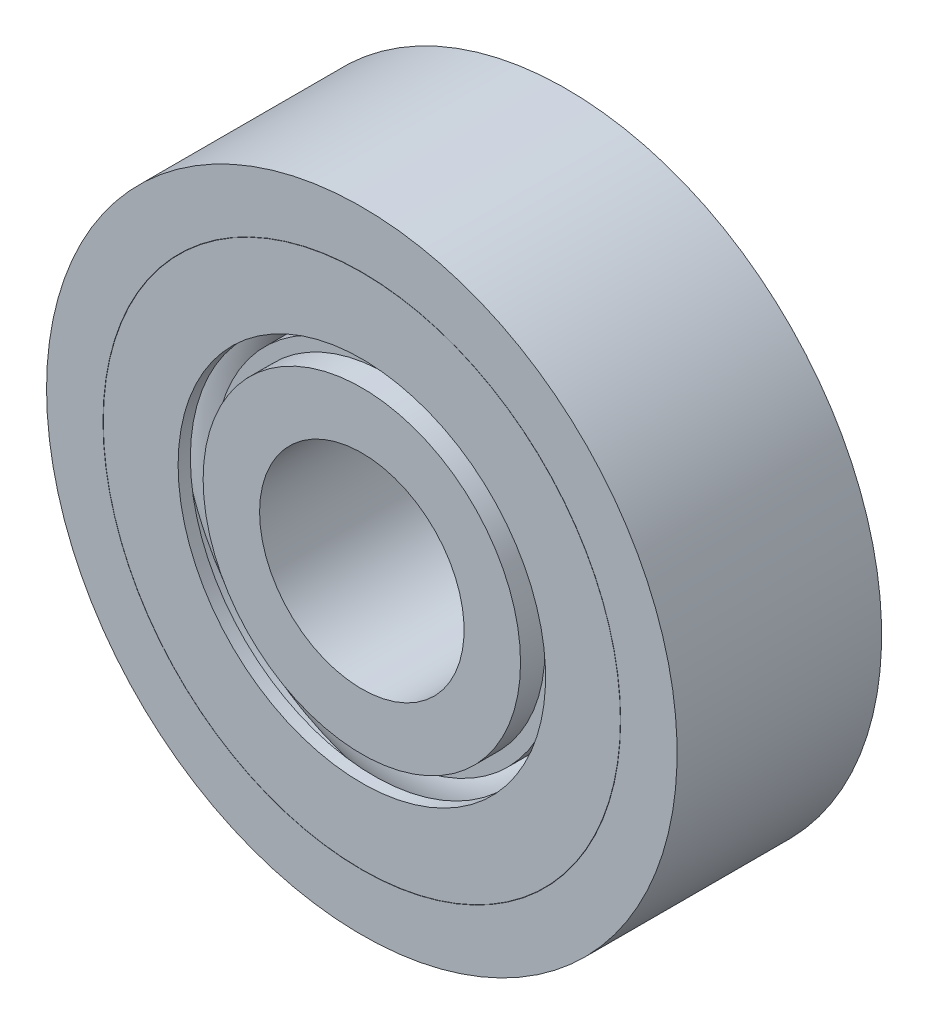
ISO-10303-21;
HEADER;
FILE_DESCRIPTION(('STEP AP214'),'2;1');
FILE_NAME('part.step','',(''),(''),'','','');
FILE_SCHEMA(('AUTOMOTIVE_DESIGN { 1 0 10303 214 1 1 1 1 }'));
ENDSEC;
DATA;
#1=APPLICATION_CONTEXT('core data for automotive mechanical design processes');
#2=APPLICATION_PROTOCOL_DEFINITION('international standard','automotive_design',2000,#1);
#3=PRODUCT_CONTEXT('',#1,'mechanical');
#4=PRODUCT('Part','Part','',(#3));
#5=PRODUCT_RELATED_PRODUCT_CATEGORY('part','',(#4));
#6=PRODUCT_DEFINITION_FORMATION('','',#4);
#7=PRODUCT_DEFINITION_CONTEXT('part definition',#1,'design');
#8=PRODUCT_DEFINITION('design','',#6,#7);
#9=PRODUCT_DEFINITION_SHAPE('','',#8);
#10=(LENGTH_UNIT() NAMED_UNIT(*) SI_UNIT(.MILLI.,.METRE.));
#11=(NAMED_UNIT(*) PLANE_ANGLE_UNIT() SI_UNIT($,.RADIAN.));
#12=(NAMED_UNIT(*) SI_UNIT($,.STERADIAN.) SOLID_ANGLE_UNIT());
#13=UNCERTAINTY_MEASURE_WITH_UNIT(LENGTH_MEASURE(1.E-05),#10,'distance_accuracy_value','');
#14=(GEOMETRIC_REPRESENTATION_CONTEXT(3) GLOBAL_UNCERTAINTY_ASSIGNED_CONTEXT((#13)) GLOBAL_UNIT_ASSIGNED_CONTEXT((#10,
#11,#12)) REPRESENTATION_CONTEXT('',''));
#15=CARTESIAN_POINT('',(0.,0.,0.));
#16=DIRECTION('',(0.,0.,1.));
#17=DIRECTION('',(1.,0.,0.));
#18=AXIS2_PLACEMENT_3D('',#15,#16,#17);
#19=CARTESIAN_POINT('',(0.,0.,6.60000000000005));
#20=DIRECTION('',(0.,0.,-1.));
#21=DIRECTION('',(-1.,0.,0.));
#22=AXIS2_PLACEMENT_3D('',#19,#20,#21);
#23=CYLINDRICAL_SURFACE('',#22,6.);
#24=CARTESIAN_POINT('',(0.,0.,6.00000000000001));
#25=DIRECTION('',(0.,0.,-1.));
#26=DIRECTION('',(-1.,0.,0.));
#27=AXIS2_PLACEMENT_3D('',#24,#25,#26);
#28=CIRCLE('',#27,6.);
#29=CARTESIAN_POINT('',(-6.,0.,6.00000000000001));
#30=VERTEX_POINT('',#29);
#31=EDGE_CURVE('P0_E18',#30,#30,#28,.F.);
#32=ORIENTED_EDGE('',*,*,#31,.T.);
#33=EDGE_LOOP('',(#32));
#34=FACE_BOUND('',#33,.T.);
#35=CARTESIAN_POINT('',(0.,0.,-6.00000000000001));
#36=DIRECTION('',(0.,0.,-1.));
#37=DIRECTION('',(-1.,0.,0.));
#38=AXIS2_PLACEMENT_3D('',#35,#36,#37);
#39=CIRCLE('',#38,6.);
#40=CARTESIAN_POINT('',(-6.,0.,-6.00000000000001));
#41=VERTEX_POINT('',#40);
#42=EDGE_CURVE('P0_E68',#41,#41,#39,.F.);
#43=ORIENTED_EDGE('',*,*,#42,.F.);
#44=EDGE_LOOP('',(#43));
#45=FACE_BOUND('',#44,.T.);
#46=ADVANCED_FACE('P0_F15',(#34,#45),#23,.F.);
#47=CARTESIAN_POINT('',(0.,0.,6.00000000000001));
#48=DIRECTION('',(0.,0.,-1.));
#49=DIRECTION('',(-1.,0.,0.));
#50=AXIS2_PLACEMENT_3D('',#47,#48,#49);
#51=PLANE('',#50);
#52=CARTESIAN_POINT('',(0.,0.,6.00000000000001));
#53=DIRECTION('',(0.,0.,-1.));
#54=DIRECTION('',(-1.,0.,0.));
#55=AXIS2_PLACEMENT_3D('',#52,#53,#54);
#56=CIRCLE('',#55,9.3125);
#57=CARTESIAN_POINT('',(-9.3125,0.,6.00000000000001));
#58=VERTEX_POINT('',#57);
#59=EDGE_CURVE('P0_E66',#58,#58,#56,.T.);
#60=ORIENTED_EDGE('',*,*,#59,.F.);
#61=EDGE_LOOP('',(#60));
#62=FACE_BOUND('',#61,.T.);
#63=ORIENTED_EDGE('',*,*,#31,.F.);
#64=EDGE_LOOP('',(#63));
#65=FACE_BOUND('',#64,.T.);
#66=ADVANCED_FACE('P0_F77',(#62,#65),#51,.F.);
#67=CARTESIAN_POINT('',(0.,0.,-6.00000000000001));
#68=DIRECTION('',(0.,0.,-1.));
#69=DIRECTION('',(-1.,0.,0.));
#70=AXIS2_PLACEMENT_3D('',#67,#68,#69);
#71=PLANE('',#70);
#72=CARTESIAN_POINT('',(0.,0.,-6.00000000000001));
#73=DIRECTION('',(0.,0.,-1.));
#74=DIRECTION('',(-1.,0.,0.));
#75=AXIS2_PLACEMENT_3D('',#72,#73,#74);
#76=CIRCLE('',#75,9.3125);
#77=CARTESIAN_POINT('',(-9.3125,0.,-6.00000000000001));
#78=VERTEX_POINT('',#77);
#79=EDGE_CURVE('P0_E63',#78,#78,#76,.F.);
#80=ORIENTED_EDGE('',*,*,#79,.F.);
#81=EDGE_LOOP('',(#80));
#82=FACE_BOUND('',#81,.T.);
#83=ORIENTED_EDGE('',*,*,#42,.T.);
#84=EDGE_LOOP('',(#83));
#85=FACE_BOUND('',#84,.T.);
#86=ADVANCED_FACE('P0_F79',(#82,#85),#71,.T.);
#87=CARTESIAN_POINT('',(0.,0.,6.60000000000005));
#88=DIRECTION('',(0.,0.,-1.));
#89=DIRECTION('',(-1.,0.,0.));
#90=AXIS2_PLACEMENT_3D('',#87,#88,#89);
#91=CYLINDRICAL_SURFACE('',#90,9.3125);
#92=ORIENTED_EDGE('',*,*,#59,.T.);
#93=EDGE_LOOP('',(#92));
#94=FACE_BOUND('',#93,.T.);
#95=CARTESIAN_POINT('',(0.,0.,4.56250000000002));
#96=DIRECTION('',(0.,0.,-1.));
#97=DIRECTION('',(-1.,0.,0.));
#98=AXIS2_PLACEMENT_3D('',#95,#96,#97);
#99=CIRCLE('',#98,9.3125);
#100=CARTESIAN_POINT('',(-9.3125,0.,4.56250000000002));
#101=VERTEX_POINT('',#100);
#102=EDGE_CURVE('P0_E60',#101,#101,#99,.F.);
#103=ORIENTED_EDGE('',*,*,#102,.T.);
#104=EDGE_LOOP('',(#103));
#105=FACE_BOUND('',#104,.T.);
#106=ADVANCED_FACE('P0_F86',(#94,#105),#91,.T.);
#107=CARTESIAN_POINT('',(0.,0.,6.60000000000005));
#108=DIRECTION('',(0.,0.,-1.));
#109=DIRECTION('',(-1.,0.,0.));
#110=AXIS2_PLACEMENT_3D('',#107,#108,#109);
#111=CYLINDRICAL_SURFACE('',#110,9.3125);
#112=ORIENTED_EDGE('',*,*,#79,.T.);
#113=EDGE_LOOP('',(#112));
#114=FACE_BOUND('',#113,.T.);
#115=CARTESIAN_POINT('',(0.,0.,-4.56250000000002));
#116=DIRECTION('',(0.,0.,-1.));
#117=DIRECTION('',(-1.,0.,0.));
#118=AXIS2_PLACEMENT_3D('',#115,#116,#117);
#119=CIRCLE('',#118,9.3125);
#120=CARTESIAN_POINT('',(-9.3125,0.,-4.56250000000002));
#121=VERTEX_POINT('',#120);
#122=EDGE_CURVE('P0_E57',#121,#121,#119,.F.);
#123=ORIENTED_EDGE('',*,*,#122,.F.);
#124=EDGE_LOOP('',(#123));
#125=FACE_BOUND('',#124,.T.);
#126=ADVANCED_FACE('P0_F173',(#114,#125),#111,.T.);
#127=CARTESIAN_POINT('',(0.,0.,4.56250000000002));
#128=DIRECTION('',(0.,0.,-1.));
#129=DIRECTION('',(-1.,0.,0.));
#130=AXIS2_PLACEMENT_3D('',#127,#128,#129);
#131=PLANE('',#130);
#132=CARTESIAN_POINT('',(0.,0.,4.56250000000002));
#133=DIRECTION('',(0.,0.,-1.));
#134=DIRECTION('',(-1.,0.,0.));
#135=AXIS2_PLACEMENT_3D('',#132,#133,#134);
#136=CIRCLE('',#135,10.075);
#137=CARTESIAN_POINT('',(-10.075,0.,4.56250000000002));
#138=VERTEX_POINT('',#137);
#139=EDGE_CURVE('P0_E54',#138,#138,#136,.T.);
#140=ORIENTED_EDGE('',*,*,#139,.F.);
#141=EDGE_LOOP('',(#140));
#142=FACE_BOUND('',#141,.T.);
#143=ORIENTED_EDGE('',*,*,#102,.F.);
#144=EDGE_LOOP('',(#143));
#145=FACE_BOUND('',#144,.T.);
#146=ADVANCED_FACE('P0_F167',(#142,#145),#131,.F.);
#147=CARTESIAN_POINT('',(0.,0.,-4.56250000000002));
#148=DIRECTION('',(0.,0.,-1.));
#149=DIRECTION('',(-1.,0.,0.));
#150=AXIS2_PLACEMENT_3D('',#147,#148,#149);
#151=PLANE('',#150);
#152=CARTESIAN_POINT('',(0.,0.,-4.56250000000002));
#153=DIRECTION('',(0.,0.,-1.));
#154=DIRECTION('',(-1.,0.,0.));
#155=AXIS2_PLACEMENT_3D('',#152,#153,#154);
#156=CIRCLE('',#155,10.075);
#157=CARTESIAN_POINT('',(-10.075,0.,-4.56250000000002));
#158=VERTEX_POINT('',#157);
#159=EDGE_CURVE('P0_E51',#158,#158,#156,.F.);
#160=ORIENTED_EDGE('',*,*,#159,.F.);
#161=EDGE_LOOP('',(#160));
#162=FACE_BOUND('',#161,.T.);
#163=ORIENTED_EDGE('',*,*,#122,.T.);
#164=EDGE_LOOP('',(#163));
#165=FACE_BOUND('',#164,.T.);
#166=ADVANCED_FACE('P0_F159',(#162,#165),#151,.T.);
#167=CARTESIAN_POINT('',(0.,0.,6.60000000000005));
#168=DIRECTION('',(0.,0.,-1.));
#169=DIRECTION('',(-1.,0.,0.));
#170=AXIS2_PLACEMENT_3D('',#167,#168,#169);
#171=CYLINDRICAL_SURFACE('',#170,10.075);
#172=ORIENTED_EDGE('',*,*,#139,.T.);
#173=EDGE_LOOP('',(#172));
#174=FACE_BOUND('',#173,.T.);
#175=CARTESIAN_POINT('',(0.,0.,2.2577865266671));
#176=DIRECTION('',(0.,0.,-1.));
#177=DIRECTION('',(0.,-1.,0.));
#178=AXIS2_PLACEMENT_3D('',#175,#176,#177);
#179=CIRCLE('',#178,10.0749999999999);
#180=CARTESIAN_POINT('',(0.,-10.0749999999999,2.2577865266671));
#181=VERTEX_POINT('',#180);
#182=EDGE_CURVE('P0_E30',#181,#181,#179,.T.);
#183=ORIENTED_EDGE('',*,*,#182,.F.);
#184=EDGE_LOOP('',(#183));
#185=FACE_BOUND('',#184,.T.);
#186=ADVANCED_FACE('P0_F156',(#174,#185),#171,.T.);
#187=CARTESIAN_POINT('',(0.,0.,6.60000000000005));
#188=DIRECTION('',(0.,0.,-1.));
#189=DIRECTION('',(-1.,0.,0.));
#190=AXIS2_PLACEMENT_3D('',#187,#188,#189);
#191=CYLINDRICAL_SURFACE('',#190,10.075);
#192=CARTESIAN_POINT('',(0.,0.,-2.25778652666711));
#193=DIRECTION('',(0.,0.,-1.));
#194=DIRECTION('',(0.,-1.,0.));
#195=AXIS2_PLACEMENT_3D('',#192,#193,#194);
#196=CIRCLE('',#195,10.0749999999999);
#197=CARTESIAN_POINT('',(0.,-10.0749999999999,-2.25778652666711));
#198=VERTEX_POINT('',#197);
#199=EDGE_CURVE('P0_E146',#198,#198,#196,.F.);
#200=ORIENTED_EDGE('',*,*,#199,.F.);
#201=EDGE_LOOP('',(#200));
#202=FACE_BOUND('',#201,.T.);
#203=ORIENTED_EDGE('',*,*,#159,.T.);
#204=EDGE_LOOP('',(#203));
#205=FACE_BOUND('',#204,.T.);
#206=ADVANCED_FACE('P0_F158',(#202,#205),#191,.T.);
#207=CARTESIAN_POINT('',(0.,0.,0.));
#208=DIRECTION('',(0.,0.,-1.));
#209=DIRECTION('',(0.,-1.,0.));
#210=AXIS2_PLACEMENT_3D('',#207,#208,#209);
#211=TOROIDAL_SURFACE('',#210,12.25,3.135);
#212=ORIENTED_EDGE('',*,*,#182,.T.);
#213=EDGE_LOOP('',(#212));
#214=FACE_BOUND('',#213,.T.);
#215=CARTESIAN_POINT('',(0.,0.,2.25778652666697));
#216=DIRECTION('',(0.,0.,-1.));
#217=DIRECTION('',(-1.,0.,0.));
#218=AXIS2_PLACEMENT_3D('',#215,#216,#217);
#219=CIRCLE('',#218,14.425);
#220=CARTESIAN_POINT('',(-14.425,0.,2.25778652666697));
#221=VERTEX_POINT('',#220);
#222=EDGE_CURVE('P0_E144',#221,#221,#219,.F.);
#223=ORIENTED_EDGE('',*,*,#222,.T.);
#224=EDGE_LOOP('',(#223));
#225=FACE_BOUND('',#224,.T.);
#226=ADVANCED_FACE('P0_F137',(#214,#225),#211,.T.);
#227=CARTESIAN_POINT('',(0.,0.,0.));
#228=DIRECTION('',(0.,0.,-1.));
#229=DIRECTION('',(0.,-1.,0.));
#230=AXIS2_PLACEMENT_3D('',#227,#228,#229);
#231=TOROIDAL_SURFACE('',#230,12.25,3.135);
#232=CARTESIAN_POINT('',(0.,0.,-2.25778652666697));
#233=DIRECTION('',(0.,0.,-1.));
#234=DIRECTION('',(-1.,0.,0.));
#235=AXIS2_PLACEMENT_3D('',#232,#233,#234);
#236=CIRCLE('',#235,14.425);
#237=CARTESIAN_POINT('',(-14.425,0.,-2.25778652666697));
#238=VERTEX_POINT('',#237);
#239=EDGE_CURVE('P0_E50',#238,#238,#236,.T.);
#240=ORIENTED_EDGE('',*,*,#239,.T.);
#241=EDGE_LOOP('',(#240));
#242=FACE_BOUND('',#241,.T.);
#243=ORIENTED_EDGE('',*,*,#199,.T.);
#244=EDGE_LOOP('',(#243));
#245=FACE_BOUND('',#244,.T.);
#246=ADVANCED_FACE('P0_F132',(#242,#245),#231,.T.);
#247=CARTESIAN_POINT('',(0.,0.,6.60000000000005));
#248=DIRECTION('',(0.,0.,-1.));
#249=DIRECTION('',(-1.,0.,0.));
#250=AXIS2_PLACEMENT_3D('',#247,#248,#249);
#251=CYLINDRICAL_SURFACE('',#250,14.425);
#252=ORIENTED_EDGE('',*,*,#222,.F.);
#253=EDGE_LOOP('',(#252));
#254=FACE_BOUND('',#253,.T.);
#255=CARTESIAN_POINT('',(0.,0.,4.56250000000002));
#256=DIRECTION('',(0.,0.,-1.));
#257=DIRECTION('',(-1.,0.,0.));
#258=AXIS2_PLACEMENT_3D('',#255,#256,#257);
#259=CIRCLE('',#258,14.425);
#260=CARTESIAN_POINT('',(-14.425,0.,4.56250000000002));
#261=VERTEX_POINT('',#260);
#262=EDGE_CURVE('P0_E47',#261,#261,#259,.F.);
#263=ORIENTED_EDGE('',*,*,#262,.T.);
#264=EDGE_LOOP('',(#263));
#265=FACE_BOUND('',#264,.T.);
#266=ADVANCED_FACE('P0_F128',(#254,#265),#251,.F.);
#267=CARTESIAN_POINT('',(0.,0.,6.60000000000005));
#268=DIRECTION('',(0.,0.,-1.));
#269=DIRECTION('',(-1.,0.,0.));
#270=AXIS2_PLACEMENT_3D('',#267,#268,#269);
#271=CYLINDRICAL_SURFACE('',#270,14.425);
#272=ORIENTED_EDGE('',*,*,#239,.F.);
#273=EDGE_LOOP('',(#272));
#274=FACE_BOUND('',#273,.T.);
#275=CARTESIAN_POINT('',(0.,0.,-4.56250000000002));
#276=DIRECTION('',(0.,0.,-1.));
#277=DIRECTION('',(-1.,0.,0.));
#278=AXIS2_PLACEMENT_3D('',#275,#276,#277);
#279=CIRCLE('',#278,14.425);
#280=CARTESIAN_POINT('',(-14.425,0.,-4.56250000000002));
#281=VERTEX_POINT('',#280);
#282=EDGE_CURVE('P0_E44',#281,#281,#279,.F.);
#283=ORIENTED_EDGE('',*,*,#282,.F.);
#284=EDGE_LOOP('',(#283));
#285=FACE_BOUND('',#284,.T.);
#286=ADVANCED_FACE('P0_F124',(#274,#285),#271,.F.);
#287=CARTESIAN_POINT('',(0.,0.,4.56250000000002));
#288=DIRECTION('',(0.,0.,-1.));
#289=DIRECTION('',(-1.,0.,0.));
#290=AXIS2_PLACEMENT_3D('',#287,#288,#289);
#291=PLANE('',#290);
#292=CARTESIAN_POINT('',(0.,0.,4.56250000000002));
#293=DIRECTION('',(0.,0.,-1.));
#294=DIRECTION('',(-1.,0.,0.));
#295=AXIS2_PLACEMENT_3D('',#292,#293,#294);
#296=CIRCLE('',#295,15.1875);
#297=CARTESIAN_POINT('',(-15.1875,0.,4.56250000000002));
#298=VERTEX_POINT('',#297);
#299=EDGE_CURVE('P0_E41',#298,#298,#296,.F.);
#300=ORIENTED_EDGE('',*,*,#299,.T.);
#301=EDGE_LOOP('',(#300));
#302=FACE_BOUND('',#301,.T.);
#303=ORIENTED_EDGE('',*,*,#262,.F.);
#304=EDGE_LOOP('',(#303));
#305=FACE_BOUND('',#304,.T.);
#306=ADVANCED_FACE('P0_F120',(#302,#305),#291,.F.);
#307=CARTESIAN_POINT('',(0.,0.,-4.56250000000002));
#308=DIRECTION('',(0.,0.,-1.));
#309=DIRECTION('',(-1.,0.,0.));
#310=AXIS2_PLACEMENT_3D('',#307,#308,#309);
#311=PLANE('',#310);
#312=CARTESIAN_POINT('',(0.,0.,-4.56250000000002));
#313=DIRECTION('',(0.,0.,-1.));
#314=DIRECTION('',(-1.,0.,0.));
#315=AXIS2_PLACEMENT_3D('',#312,#313,#314);
#316=CIRCLE('',#315,15.1875);
#317=CARTESIAN_POINT('',(-15.1875,0.,-4.56250000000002));
#318=VERTEX_POINT('',#317);
#319=EDGE_CURVE('P0_E38',#318,#318,#316,.T.);
#320=ORIENTED_EDGE('',*,*,#319,.T.);
#321=EDGE_LOOP('',(#320));
#322=FACE_BOUND('',#321,.T.);
#323=ORIENTED_EDGE('',*,*,#282,.T.);
#324=EDGE_LOOP('',(#323));
#325=FACE_BOUND('',#324,.T.);
#326=ADVANCED_FACE('P0_F116',(#322,#325),#311,.T.);
#327=CARTESIAN_POINT('',(0.,0.,6.60000000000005));
#328=DIRECTION('',(0.,0.,-1.));
#329=DIRECTION('',(-1.,0.,0.));
#330=AXIS2_PLACEMENT_3D('',#327,#328,#329);
#331=CYLINDRICAL_SURFACE('',#330,15.1875);
#332=ORIENTED_EDGE('',*,*,#299,.F.);
#333=EDGE_LOOP('',(#332));
#334=FACE_BOUND('',#333,.T.);
#335=CARTESIAN_POINT('',(0.,0.,6.00000000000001));
#336=DIRECTION('',(0.,0.,-1.));
#337=DIRECTION('',(-1.,0.,0.));
#338=AXIS2_PLACEMENT_3D('',#335,#336,#337);
#339=CIRCLE('',#338,15.1875);
#340=CARTESIAN_POINT('',(-15.1875,0.,6.00000000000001));
#341=VERTEX_POINT('',#340);
#342=EDGE_CURVE('P0_E35',#341,#341,#339,.F.);
#343=ORIENTED_EDGE('',*,*,#342,.T.);
#344=EDGE_LOOP('',(#343));
#345=FACE_BOUND('',#344,.T.);
#346=ADVANCED_FACE('P0_F112',(#334,#345),#331,.F.);
#347=CARTESIAN_POINT('',(0.,0.,6.60000000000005));
#348=DIRECTION('',(0.,0.,-1.));
#349=DIRECTION('',(-1.,0.,0.));
#350=AXIS2_PLACEMENT_3D('',#347,#348,#349);
#351=CYLINDRICAL_SURFACE('',#350,15.1875);
#352=ORIENTED_EDGE('',*,*,#319,.F.);
#353=EDGE_LOOP('',(#352));
#354=FACE_BOUND('',#353,.T.);
#355=CARTESIAN_POINT('',(0.,0.,-6.00000000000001));
#356=DIRECTION('',(0.,0.,-1.));
#357=DIRECTION('',(-1.,0.,0.));
#358=AXIS2_PLACEMENT_3D('',#355,#356,#357);
#359=CIRCLE('',#358,15.1875);
#360=CARTESIAN_POINT('',(-15.1875,0.,-6.00000000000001));
#361=VERTEX_POINT('',#360);
#362=EDGE_CURVE('P0_E27',#361,#361,#359,.F.);
#363=ORIENTED_EDGE('',*,*,#362,.F.);
#364=EDGE_LOOP('',(#363));
#365=FACE_BOUND('',#364,.T.);
#366=ADVANCED_FACE('P0_F108',(#354,#365),#351,.F.);
#367=CARTESIAN_POINT('',(0.,0.,6.00000000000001));
#368=DIRECTION('',(0.,0.,-1.));
#369=DIRECTION('',(-1.,0.,0.));
#370=AXIS2_PLACEMENT_3D('',#367,#368,#369);
#371=PLANE('',#370);
#372=CARTESIAN_POINT('',(0.,0.,6.00000000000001));
#373=DIRECTION('',(0.,0.,-1.));
#374=DIRECTION('',(-1.,0.,0.));
#375=AXIS2_PLACEMENT_3D('',#372,#373,#374);
#376=CIRCLE('',#375,18.5);
#377=CARTESIAN_POINT('',(-18.5,0.,6.00000000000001));
#378=VERTEX_POINT('',#377);
#379=EDGE_CURVE('P0_E22',#378,#378,#376,.T.);
#380=ORIENTED_EDGE('',*,*,#379,.F.);
#381=EDGE_LOOP('',(#380));
#382=FACE_BOUND('',#381,.T.);
#383=ORIENTED_EDGE('',*,*,#342,.F.);
#384=EDGE_LOOP('',(#383));
#385=FACE_BOUND('',#384,.T.);
#386=ADVANCED_FACE('P0_F98',(#382,#385),#371,.F.);
#387=CARTESIAN_POINT('',(0.,0.,-6.00000000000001));
#388=DIRECTION('',(0.,0.,-1.));
#389=DIRECTION('',(-1.,0.,0.));
#390=AXIS2_PLACEMENT_3D('',#387,#388,#389);
#391=PLANE('',#390);
#392=CARTESIAN_POINT('',(0.,0.,-6.00000000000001));
#393=DIRECTION('',(0.,0.,-1.));
#394=DIRECTION('',(-1.,0.,0.));
#395=AXIS2_PLACEMENT_3D('',#392,#393,#394);
#396=CIRCLE('',#395,18.5);
#397=CARTESIAN_POINT('',(-18.5,0.,-6.00000000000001));
#398=VERTEX_POINT('',#397);
#399=EDGE_CURVE('P0_E10',#398,#398,#396,.F.);
#400=ORIENTED_EDGE('',*,*,#399,.F.);
#401=EDGE_LOOP('',(#400));
#402=FACE_BOUND('',#401,.T.);
#403=ORIENTED_EDGE('',*,*,#362,.T.);
#404=EDGE_LOOP('',(#403));
#405=FACE_BOUND('',#404,.T.);
#406=ADVANCED_FACE('P0_F92',(#402,#405),#391,.T.);
#407=CARTESIAN_POINT('',(0.,0.,6.60000000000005));
#408=DIRECTION('',(0.,0.,-1.));
#409=DIRECTION('',(-1.,0.,0.));
#410=AXIS2_PLACEMENT_3D('',#407,#408,#409);
#411=CYLINDRICAL_SURFACE('',#410,18.5);
#412=ORIENTED_EDGE('',*,*,#399,.T.);
#413=EDGE_LOOP('',(#412));
#414=FACE_BOUND('',#413,.T.);
#415=ORIENTED_EDGE('',*,*,#379,.T.);
#416=EDGE_LOOP('',(#415));
#417=FACE_BOUND('',#416,.T.);
#418=ADVANCED_FACE('P0_F90',(#414,#417),#411,.T.);
#419=CLOSED_SHELL('',(#46,#66,#86,#106,#126,#146,#166,#186,#206,#226,#246,#266,#286,#306,#326,
#346,#366,#386,#406,#418));
#420=CARTESIAN_POINT('',(0.,0.,0.));
#421=DIRECTION('',(0.,0.,-1.));
#422=DIRECTION('',(0.,-1.,0.));
#423=AXIS2_PLACEMENT_3D('',#420,#421,#422);
#424=TOROIDAL_SURFACE('',#423,12.25,3.125);
#425=ADVANCED_FACE('P0_F103',(),#424,.F.);
#426=CLOSED_SHELL('',(#425));
#427=ORIENTED_CLOSED_SHELL('',*,#426,.T.);
#428=BREP_WITH_VOIDS('P0_B1',#419,(#427));
#429=CARTESIAN_POINT('',(0.,0.,5.28125000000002));
#430=DIRECTION('',(0.,0.,-1.));
#431=DIRECTION('',(-1.,0.,0.));
#432=AXIS2_PLACEMENT_3D('',#429,#430,#431);
#433=PLANE('',#432);
#434=CARTESIAN_POINT('',(0.,0.,5.28125000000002));
#435=DIRECTION('',(0.,0.,-1.));
#436=DIRECTION('',(-1.,0.,0.));
#437=AXIS2_PLACEMENT_3D('',#434,#435,#436);
#438=CIRCLE('',#437,15.1725);
#439=CARTESIAN_POINT('',(-15.1725,0.,5.28125000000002));
#440=VERTEX_POINT('',#439);
#441=EDGE_CURVE('P1_E26',#440,#440,#438,.F.);
#442=ORIENTED_EDGE('',*,*,#441,.F.);
#443=EDGE_LOOP('',(#442));
#444=FACE_BOUND('',#443,.T.);
#445=CARTESIAN_POINT('',(0.,0.,5.28125000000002));
#446=DIRECTION('',(0.,0.,-1.));
#447=DIRECTION('',(-1.,0.,0.));
#448=AXIS2_PLACEMENT_3D('',#445,#446,#447);
#449=CIRCLE('',#448,10.78125);
#450=CARTESIAN_POINT('',(-10.78125,0.,5.28125000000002));
#451=VERTEX_POINT('',#450);
#452=EDGE_CURVE('P1_E17',#451,#451,#449,.F.);
#453=ORIENTED_EDGE('',*,*,#452,.T.);
#454=EDGE_LOOP('',(#453));
#455=FACE_BOUND('',#454,.T.);
#456=ADVANCED_FACE('P1_F14',(#444,#455),#433,.T.);
#457=CARTESIAN_POINT('',(0.,0.,6.60000000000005));
#458=DIRECTION('',(0.,0.,-1.));
#459=DIRECTION('',(-1.,0.,0.));
#460=AXIS2_PLACEMENT_3D('',#457,#458,#459);
#461=CYLINDRICAL_SURFACE('',#460,10.78125);
#462=ORIENTED_EDGE('',*,*,#452,.F.);
#463=EDGE_LOOP('',(#462));
#464=FACE_BOUND('',#463,.T.);
#465=CARTESIAN_POINT('',(0.,0.,6.00000000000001));
#466=DIRECTION('',(0.,0.,-1.));
#467=DIRECTION('',(-1.,0.,0.));
#468=AXIS2_PLACEMENT_3D('',#465,#466,#467);
#469=CIRCLE('',#468,10.78125);
#470=CARTESIAN_POINT('',(-10.78125,0.,6.00000000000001));
#471=VERTEX_POINT('',#470);
#472=EDGE_CURVE('P1_E21',#471,#471,#469,.F.);
#473=ORIENTED_EDGE('',*,*,#472,.T.);
#474=EDGE_LOOP('',(#473));
#475=FACE_BOUND('',#474,.T.);
#476=ADVANCED_FACE('P1_F35',(#464,#475),#461,.F.);
#477=CARTESIAN_POINT('',(0.,0.,6.60000000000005));
#478=DIRECTION('',(0.,0.,-1.));
#479=DIRECTION('',(-1.,0.,0.));
#480=AXIS2_PLACEMENT_3D('',#477,#478,#479);
#481=CYLINDRICAL_SURFACE('',#480,15.1725);
#482=ORIENTED_EDGE('',*,*,#441,.T.);
#483=EDGE_LOOP('',(#482));
#484=FACE_BOUND('',#483,.T.);
#485=CARTESIAN_POINT('',(0.,0.,6.00000000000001));
#486=DIRECTION('',(0.,0.,-1.));
#487=DIRECTION('',(-1.,0.,0.));
#488=AXIS2_PLACEMENT_3D('',#485,#486,#487);
#489=CIRCLE('',#488,15.1725);
#490=CARTESIAN_POINT('',(-15.1725,0.,6.00000000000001));
#491=VERTEX_POINT('',#490);
#492=EDGE_CURVE('P1_E10',#491,#491,#489,.T.);
#493=ORIENTED_EDGE('',*,*,#492,.T.);
#494=EDGE_LOOP('',(#493));
#495=FACE_BOUND('',#494,.T.);
#496=ADVANCED_FACE('P1_F38',(#484,#495),#481,.T.);
#497=CARTESIAN_POINT('',(0.,0.,6.00000000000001));
#498=DIRECTION('',(0.,0.,-1.));
#499=DIRECTION('',(-1.,0.,0.));
#500=AXIS2_PLACEMENT_3D('',#497,#498,#499);
#501=PLANE('',#500);
#502=ORIENTED_EDGE('',*,*,#492,.F.);
#503=EDGE_LOOP('',(#502));
#504=FACE_BOUND('',#503,.T.);
#505=ORIENTED_EDGE('',*,*,#472,.F.);
#506=EDGE_LOOP('',(#505));
#507=FACE_BOUND('',#506,.T.);
#508=ADVANCED_FACE('P1_F41',(#504,#507),#501,.F.);
#509=CLOSED_SHELL('',(#456,#476,#496,#508));
#510=MANIFOLD_SOLID_BREP('P1_B1',#509);
#511=ADVANCED_BREP_SHAPE_REPRESENTATION('',(#18,#428,#510),#14);
#512=SHAPE_DEFINITION_REPRESENTATION(#9,#511);
ENDSEC;
END-ISO-10303-21;
